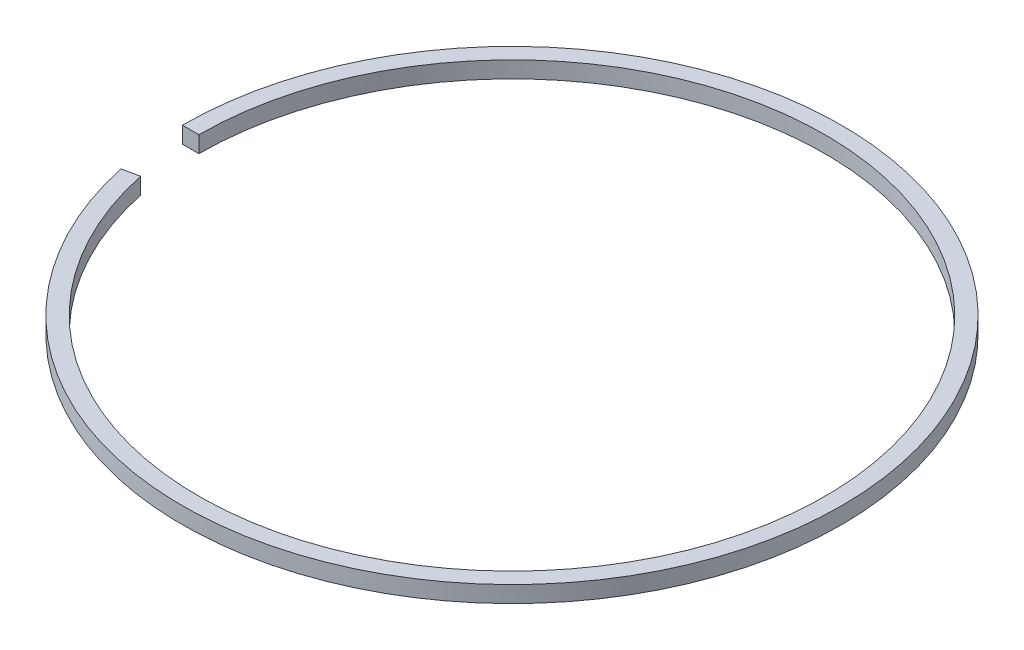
from build123d import *

# Parameters (mm, degrees)
SKETCH1_W      = 3.175
SKETCH1_H      = 3.175
REVOLVE1_ANGLE = 348


with BuildPart() as part:
    # Sketch1 → Revolve1 (revolve)
    with BuildSketch(Plane.XY):
        with Locations((-61.9125, 1.5875)):
            Rectangle(SKETCH1_W, SKETCH1_H)
    revolve(axis=Axis((0, 25.531055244, 0), (0, -1, 0)), revolution_arc=REVOLVE1_ANGLE)


solid = part.part
